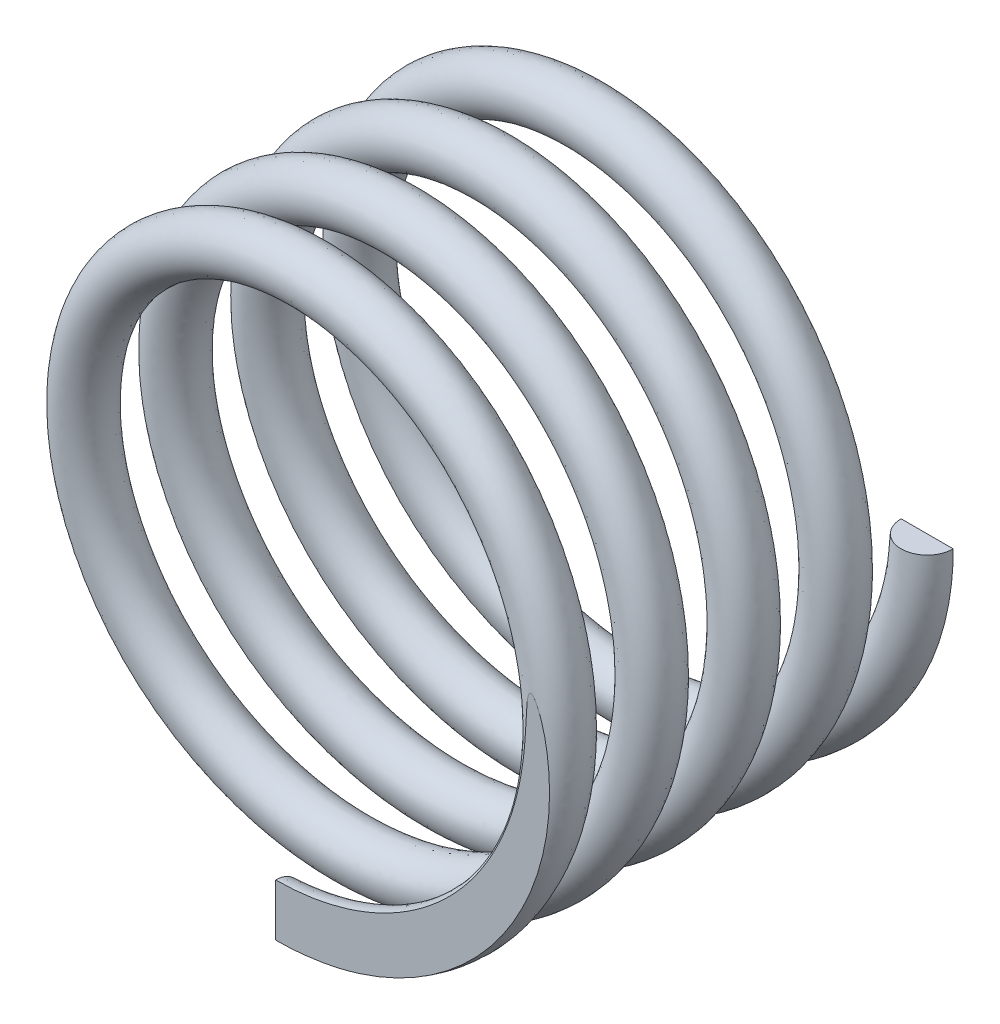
from build123d import *

# Parameters (mm, degrees)
SWEEP1_PITCH            = 1.764705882
SWEEP1_HEIGHT           = 7.5
SWEEP1_RADIUS           = 5.5
SKETCH3_R               = 0.5
CUT_EXTRUDE1_DEPTH      = 12.157974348
CUT_EXTRUDE1_DEPTH_BACK = 12.157974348
SKETCH4_W               = 12.095348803
SKETCH4_H               = 0.5
SKETCH4_W_2             = 24.190697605
SKETCH4_H_2             = 1


with BuildPart() as part:
    # Sweep1: sweep along a helix
    with BuildLine() as sweep1_path:
        Helix(SWEEP1_PITCH, SWEEP1_HEIGHT, SWEEP1_RADIUS, center=(0, 0, 0), direction=(0, 0, 1), lefthand=True)
    # Sketch3 → Sweep1 (sweep)
    with BuildSketch(Plane(origin=(0, 0, 0), x_dir=(1, 0, 0), z_dir=(0, 1, 0))):
        with Locations((5, 0)):
            Circle(SKETCH3_R)
    sweep(path=sweep1_path.line, is_frenet=True)

    # Sketch4 → Cut-Extrude1 (cut, two sides: drawn at the far end of the back side and taken through both)
    with BuildSketch(Plane(origin=(0, 0, 0), x_dir=(1, 0, 0), z_dir=(0, 1, 0)).offset(-CUT_EXTRUDE1_DEPTH_BACK)):
        with Locations((-0.547674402, 0.25)):
            Rectangle(SKETCH4_W, SKETCH4_H)
        with Locations((-6.595348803, -8)):
            Rectangle(SKETCH4_W_2, SKETCH4_H_2)
    extrude(amount=CUT_EXTRUDE1_DEPTH + CUT_EXTRUDE1_DEPTH_BACK, mode=Mode.SUBTRACT)


solid = part.part
